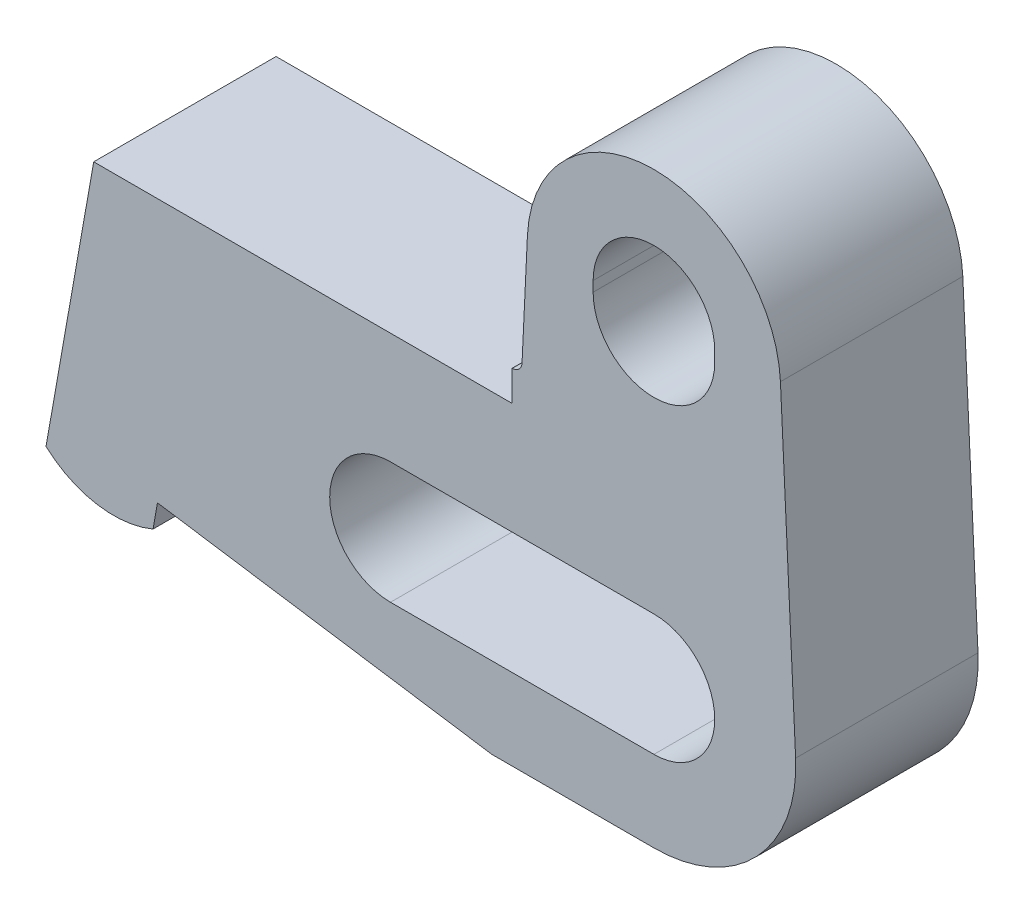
from build123d import *

# Parameters (mm, degrees)
EXTRUSION1_DEPTH = 9


with BuildPart() as part:
    # Esquisse1 → Extrusion1 (new, symmetric)
    with BuildSketch(Plane.XY):
        with BuildLine():
            Line((12.485819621, 32.095238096), (13.984117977, 0.666666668))
            ThreePointArc((13.984117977, 0.666666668), (10.132456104, -9.660917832), (0, -14.000000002))
            Line((0, -14.000000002), (-16, -14.000000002))
            Line((-16, -14.000000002), (-49, -9))
            Line((-49, -9), (-49.434120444, -11.462019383))
            ThreePointArc((-49.434120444, -11.462019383), (-54.973472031, -12.113185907), (-60, -9.696069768))
            Line((-60, -9.696069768), (-55.292762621, 17))
            Line((-55.292762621, 17), (-14, 17))
            Line((-14, 17), (-14, 20))
            Line((-14, 20), (-13.953462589, 20))
            ThreePointArc((-13.953462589, 20), (-13.303626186, 20.296236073), (-13.017127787, 20.950423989))
            Line((-13.017127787, 20.950423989), (-12.485819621, 32.095238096))
            ThreePointArc((-12.485819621, 32.095238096), (0, 44), (12.485819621, 32.095238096))
        make_face()
        with BuildLine():
            Line((-26, 6), (0, 6))
            ThreePointArc((0, 6), (6, 0), (0, -6))
            Line((0, -6), (-26, -6))
            ThreePointArc((-26, -6), (-32, 0), (-26, 6))
        make_face(mode=Mode.SUBTRACT)
        with BuildLine():
            Line((6, 31.5), (6, 30.5))
            ThreePointArc((6, 30.5), (0, 24.5), (-6, 30.5))
            Line((-6, 30.5), (-6, 31.5))
            ThreePointArc((-6, 31.5), (0, 37.5), (6, 31.5))
        make_face(mode=Mode.SUBTRACT)
    extrude(amount=EXTRUSION1_DEPTH, both=True)


solid = part.part
